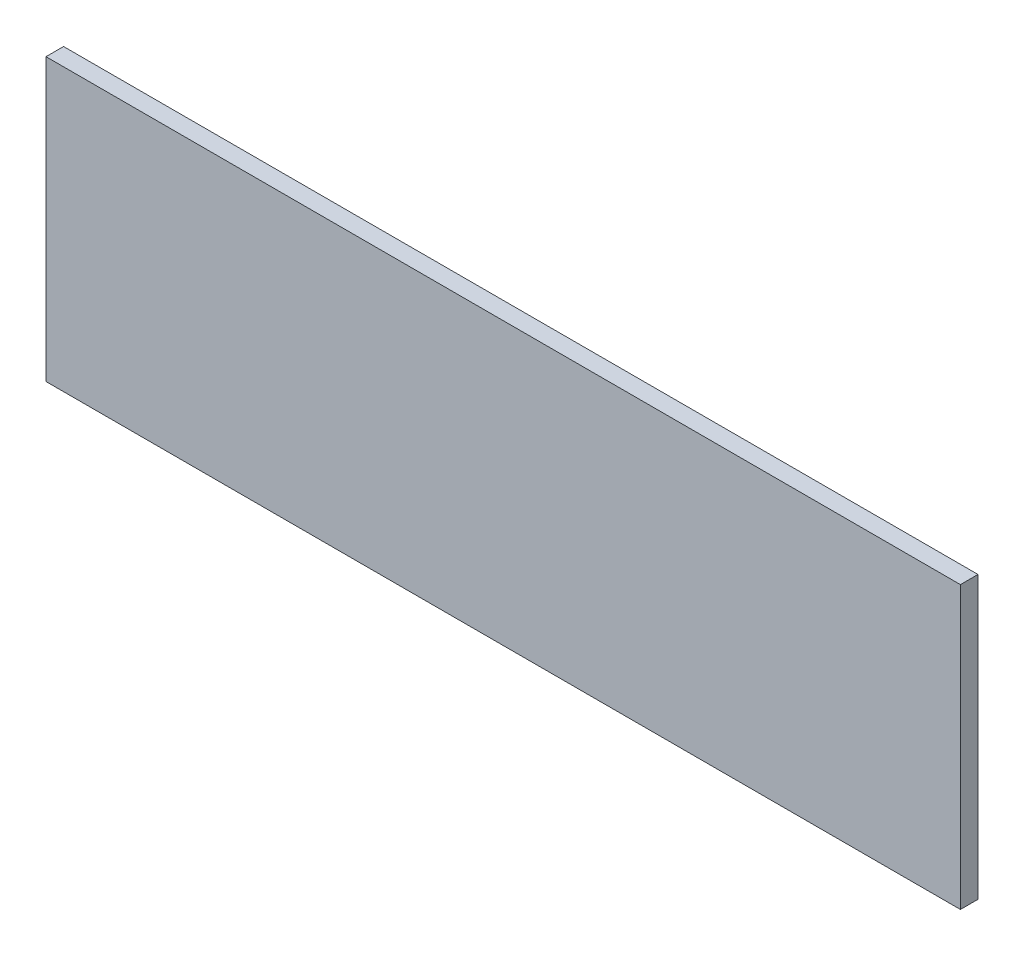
ISO-10303-21;
HEADER;
FILE_DESCRIPTION(('STEP AP214'),'2;1');
FILE_NAME('part.step','',(''),(''),'','','');
FILE_SCHEMA(('AUTOMOTIVE_DESIGN { 1 0 10303 214 1 1 1 1 }'));
ENDSEC;
DATA;
#1=APPLICATION_CONTEXT('core data for automotive mechanical design processes');
#2=APPLICATION_PROTOCOL_DEFINITION('international standard','automotive_design',2000,#1);
#3=PRODUCT_CONTEXT('',#1,'mechanical');
#4=PRODUCT('Part','Part','',(#3));
#5=PRODUCT_RELATED_PRODUCT_CATEGORY('part','',(#4));
#6=PRODUCT_DEFINITION_FORMATION('','',#4);
#7=PRODUCT_DEFINITION_CONTEXT('part definition',#1,'design');
#8=PRODUCT_DEFINITION('design','',#6,#7);
#9=PRODUCT_DEFINITION_SHAPE('','',#8);
#10=(LENGTH_UNIT() NAMED_UNIT(*) SI_UNIT(.MILLI.,.METRE.));
#11=(NAMED_UNIT(*) PLANE_ANGLE_UNIT() SI_UNIT($,.RADIAN.));
#12=(NAMED_UNIT(*) SI_UNIT($,.STERADIAN.) SOLID_ANGLE_UNIT());
#13=UNCERTAINTY_MEASURE_WITH_UNIT(LENGTH_MEASURE(1.E-05),#10,'distance_accuracy_value','');
#14=(GEOMETRIC_REPRESENTATION_CONTEXT(3) GLOBAL_UNCERTAINTY_ASSIGNED_CONTEXT((#13)) GLOBAL_UNIT_ASSIGNED_CONTEXT((#10,
#11,#12)) REPRESENTATION_CONTEXT('',''));
#15=CARTESIAN_POINT('',(0.,0.,0.));
#16=DIRECTION('',(0.,0.,1.));
#17=DIRECTION('',(1.,0.,0.));
#18=AXIS2_PLACEMENT_3D('',#15,#16,#17);
#19=CARTESIAN_POINT('',(-387.132301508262,146.204792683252,15.));
#20=DIRECTION('',(1.,0.,0.));
#21=DIRECTION('',(0.,1.,0.));
#22=AXIS2_PLACEMENT_3D('',#19,#20,#21);
#23=PLANE('',#22);
#24=DIRECTION('',(0.,-1.,0.));
#25=VECTOR('',#24,1.);
#26=CARTESIAN_POINT('',(-387.132301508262,146.204792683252,0.));
#27=LINE('',#26,#25);
#28=CARTESIAN_POINT('',(-387.132301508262,146.204792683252,0.));
#29=VERTEX_POINT('',#28);
#30=CARTESIAN_POINT('',(-387.132301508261,-93.795207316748,0.));
#31=VERTEX_POINT('',#30);
#32=EDGE_CURVE('E100',#29,#31,#27,.T.);
#33=ORIENTED_EDGE('',*,*,#32,.T.);
#34=DIRECTION('',(0.,0.,-1.));
#35=VECTOR('',#34,1.);
#36=CARTESIAN_POINT('',(-387.132301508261,-93.795207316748,15.));
#37=LINE('',#36,#35);
#38=CARTESIAN_POINT('',(-387.132301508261,-93.795207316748,15.));
#39=VERTEX_POINT('',#38);
#40=EDGE_CURVE('E11',#39,#31,#37,.T.);
#41=ORIENTED_EDGE('',*,*,#40,.F.);
#42=DIRECTION('',(0.,-1.,0.));
#43=VECTOR('',#42,1.);
#44=CARTESIAN_POINT('',(-387.132301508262,146.204792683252,15.));
#45=LINE('',#44,#43);
#46=CARTESIAN_POINT('',(-387.132301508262,146.204792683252,15.));
#47=VERTEX_POINT('',#46);
#48=EDGE_CURVE('E88',#47,#39,#45,.T.);
#49=ORIENTED_EDGE('',*,*,#48,.F.);
#50=DIRECTION('',(0.,0.,-1.));
#51=VECTOR('',#50,1.);
#52=CARTESIAN_POINT('',(-387.132301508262,146.204792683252,15.));
#53=LINE('',#52,#51);
#54=EDGE_CURVE('E96',#47,#29,#53,.T.);
#55=ORIENTED_EDGE('',*,*,#54,.T.);
#56=EDGE_LOOP('',(#33,#41,#49,#55));
#57=FACE_BOUND('',#56,.T.);
#58=ADVANCED_FACE('F37',(#57),#23,.F.);
#59=CARTESIAN_POINT('',(-387.132301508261,-93.795207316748,15.));
#60=DIRECTION('',(0.,1.,0.));
#61=DIRECTION('',(-1.,0.,0.));
#62=AXIS2_PLACEMENT_3D('',#59,#60,#61);
#63=PLANE('',#62);
#64=DIRECTION('',(1.,0.,0.));
#65=VECTOR('',#64,1.);
#66=CARTESIAN_POINT('',(-387.132301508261,-93.795207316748,0.));
#67=LINE('',#66,#65);
#68=CARTESIAN_POINT('',(392.867698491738,-93.795207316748,0.));
#69=VERTEX_POINT('',#68);
#70=EDGE_CURVE('E92',#31,#69,#67,.T.);
#71=ORIENTED_EDGE('',*,*,#70,.T.);
#72=DIRECTION('',(0.,0.,-1.));
#73=VECTOR('',#72,1.);
#74=CARTESIAN_POINT('',(392.867698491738,-93.795207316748,15.));
#75=LINE('',#74,#73);
#76=CARTESIAN_POINT('',(392.867698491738,-93.795207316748,15.));
#77=VERTEX_POINT('',#76);
#78=EDGE_CURVE('E45',#77,#69,#75,.T.);
#79=ORIENTED_EDGE('',*,*,#78,.F.);
#80=DIRECTION('',(1.,0.,0.));
#81=VECTOR('',#80,1.);
#82=CARTESIAN_POINT('',(-387.132301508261,-93.795207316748,15.));
#83=LINE('',#82,#81);
#84=EDGE_CURVE('E83',#39,#77,#83,.T.);
#85=ORIENTED_EDGE('',*,*,#84,.F.);
#86=ORIENTED_EDGE('',*,*,#40,.T.);
#87=EDGE_LOOP('',(#71,#79,#85,#86));
#88=FACE_BOUND('',#87,.T.);
#89=ADVANCED_FACE('F91',(#88),#63,.F.);
#90=CARTESIAN_POINT('',(392.867698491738,146.204792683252,15.));
#91=DIRECTION('',(-1.,0.,0.));
#92=DIRECTION('',(0.,-1.,0.));
#93=AXIS2_PLACEMENT_3D('',#90,#91,#92);
#94=PLANE('',#93);
#95=DIRECTION('',(0.,1.,0.));
#96=VECTOR('',#95,1.);
#97=CARTESIAN_POINT('',(392.867698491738,146.204792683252,0.));
#98=LINE('',#97,#96);
#99=CARTESIAN_POINT('',(392.867698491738,146.204792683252,0.));
#100=VERTEX_POINT('',#99);
#101=EDGE_CURVE('E70',#69,#100,#98,.T.);
#102=ORIENTED_EDGE('',*,*,#101,.T.);
#103=DIRECTION('',(0.,0.,-1.));
#104=VECTOR('',#103,1.);
#105=CARTESIAN_POINT('',(392.867698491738,146.204792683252,15.));
#106=LINE('',#105,#104);
#107=CARTESIAN_POINT('',(392.867698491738,146.204792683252,15.));
#108=VERTEX_POINT('',#107);
#109=EDGE_CURVE('E93',#108,#100,#106,.T.);
#110=ORIENTED_EDGE('',*,*,#109,.F.);
#111=DIRECTION('',(0.,1.,0.));
#112=VECTOR('',#111,1.);
#113=CARTESIAN_POINT('',(392.867698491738,146.204792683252,15.));
#114=LINE('',#113,#112);
#115=EDGE_CURVE('E86',#77,#108,#114,.T.);
#116=ORIENTED_EDGE('',*,*,#115,.F.);
#117=ORIENTED_EDGE('',*,*,#78,.T.);
#118=EDGE_LOOP('',(#102,#110,#116,#117));
#119=FACE_BOUND('',#118,.T.);
#120=ADVANCED_FACE('F94',(#119),#94,.F.);
#121=CARTESIAN_POINT('',(-387.132301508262,146.204792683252,15.));
#122=DIRECTION('',(0.,-1.,0.));
#123=DIRECTION('',(1.,0.,0.));
#124=AXIS2_PLACEMENT_3D('',#121,#122,#123);
#125=PLANE('',#124);
#126=DIRECTION('',(-1.,0.,0.));
#127=VECTOR('',#126,1.);
#128=CARTESIAN_POINT('',(-387.132301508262,146.204792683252,0.));
#129=LINE('',#128,#127);
#130=EDGE_CURVE('E76',#100,#29,#129,.T.);
#131=ORIENTED_EDGE('',*,*,#130,.T.);
#132=ORIENTED_EDGE('',*,*,#54,.F.);
#133=DIRECTION('',(-1.,0.,0.));
#134=VECTOR('',#133,1.);
#135=CARTESIAN_POINT('',(-387.132301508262,146.204792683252,15.));
#136=LINE('',#135,#134);
#137=EDGE_CURVE('E53',#108,#47,#136,.T.);
#138=ORIENTED_EDGE('',*,*,#137,.F.);
#139=ORIENTED_EDGE('',*,*,#109,.T.);
#140=EDGE_LOOP('',(#131,#132,#138,#139));
#141=FACE_BOUND('',#140,.T.);
#142=ADVANCED_FACE('F107',(#141),#125,.F.);
#143=CARTESIAN_POINT('',(0.,0.,15.));
#144=DIRECTION('',(0.,0.,1.));
#145=DIRECTION('',(1.,0.,0.));
#146=AXIS2_PLACEMENT_3D('',#143,#144,#145);
#147=PLANE('',#146);
#148=ORIENTED_EDGE('',*,*,#48,.T.);
#149=ORIENTED_EDGE('',*,*,#84,.T.);
#150=ORIENTED_EDGE('',*,*,#115,.T.);
#151=ORIENTED_EDGE('',*,*,#137,.T.);
#152=EDGE_LOOP('',(#148,#149,#150,#151));
#153=FACE_BOUND('',#152,.T.);
#154=ADVANCED_FACE('F84',(#153),#147,.T.);
#155=CARTESIAN_POINT('',(0.,0.,0.));
#156=DIRECTION('',(0.,0.,1.));
#157=DIRECTION('',(1.,0.,0.));
#158=AXIS2_PLACEMENT_3D('',#155,#156,#157);
#159=PLANE('',#158);
#160=ORIENTED_EDGE('',*,*,#32,.F.);
#161=ORIENTED_EDGE('',*,*,#130,.F.);
#162=ORIENTED_EDGE('',*,*,#101,.F.);
#163=ORIENTED_EDGE('',*,*,#70,.F.);
#164=EDGE_LOOP('',(#160,#161,#162,#163));
#165=FACE_BOUND('',#164,.T.);
#166=ADVANCED_FACE('F110',(#165),#159,.F.);
#167=CLOSED_SHELL('',(#58,#89,#120,#142,#154,#166));
#168=MANIFOLD_SOLID_BREP('B2',#167);
#169=ADVANCED_BREP_SHAPE_REPRESENTATION('',(#18,#168),#14);
#170=SHAPE_DEFINITION_REPRESENTATION(#9,#169);
ENDSEC;
END-ISO-10303-21;
